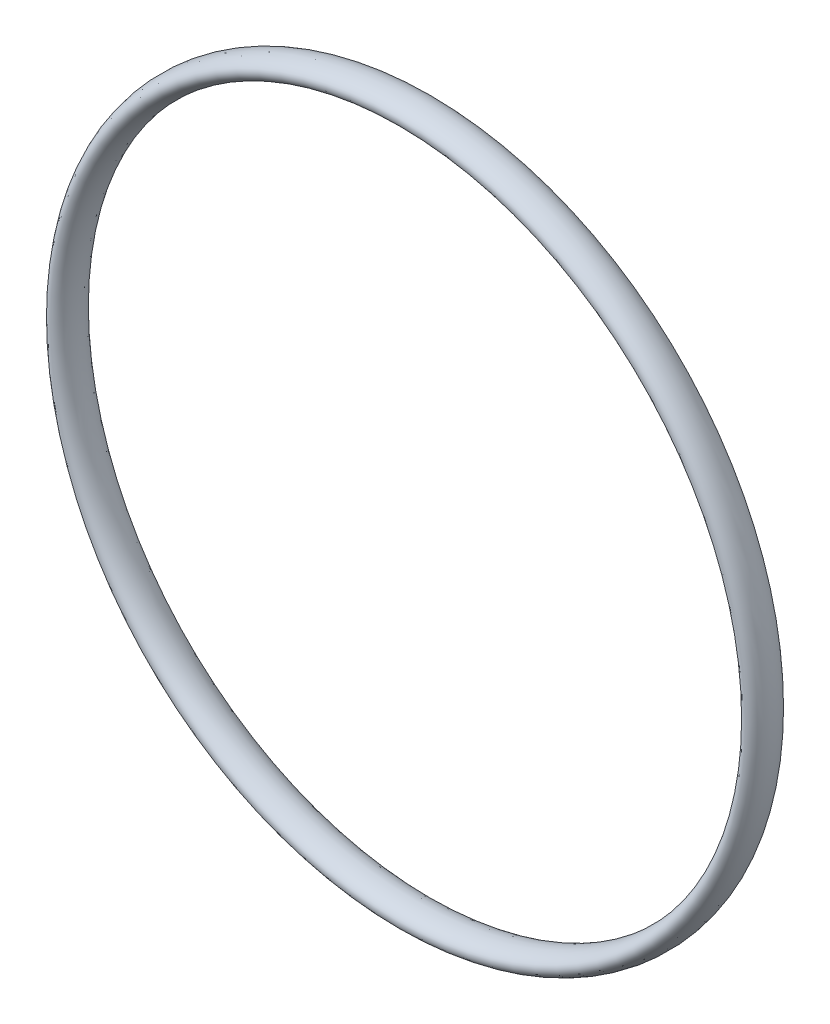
from build123d import *

# Parameters (mm, degrees)
ESQUISSE1_RX = 2.4
ESQUISSE1_RY = 1.45


with BuildPart() as part:
    # Esquisse1 → Base-R_volution (revolve)
    with BuildSketch(Plane(origin=(0, 0, 0), x_dir=(0, 0, -1), z_dir=(1, 0, 0))):
        with Locations((2.4, 46.45)):
            Ellipse(ESQUISSE1_RX, ESQUISSE1_RY)
    revolve(axis=Axis((0, 0, 0), (0, 0, -1)))


solid = part.part
